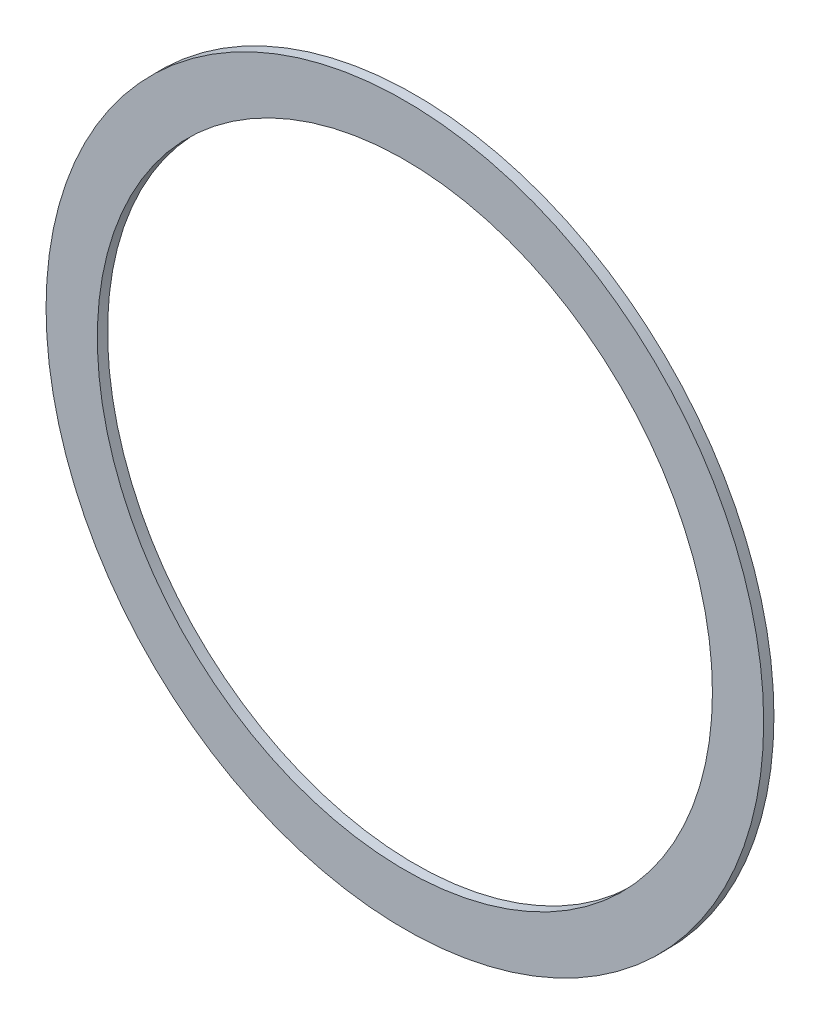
ISO-10303-21;
HEADER;
FILE_DESCRIPTION(('STEP AP214'),'2;1');
FILE_NAME('part.step','',(''),(''),'','','');
FILE_SCHEMA(('AUTOMOTIVE_DESIGN { 1 0 10303 214 1 1 1 1 }'));
ENDSEC;
DATA;
#1=APPLICATION_CONTEXT('core data for automotive mechanical design processes');
#2=APPLICATION_PROTOCOL_DEFINITION('international standard','automotive_design',2000,#1);
#3=PRODUCT_CONTEXT('',#1,'mechanical');
#4=PRODUCT('Part','Part','',(#3));
#5=PRODUCT_RELATED_PRODUCT_CATEGORY('part','',(#4));
#6=PRODUCT_DEFINITION_FORMATION('','',#4);
#7=PRODUCT_DEFINITION_CONTEXT('part definition',#1,'design');
#8=PRODUCT_DEFINITION('design','',#6,#7);
#9=PRODUCT_DEFINITION_SHAPE('','',#8);
#10=(LENGTH_UNIT() NAMED_UNIT(*) SI_UNIT(.MILLI.,.METRE.));
#11=(NAMED_UNIT(*) PLANE_ANGLE_UNIT() SI_UNIT($,.RADIAN.));
#12=(NAMED_UNIT(*) SI_UNIT($,.STERADIAN.) SOLID_ANGLE_UNIT());
#13=UNCERTAINTY_MEASURE_WITH_UNIT(LENGTH_MEASURE(1.E-05),#10,'distance_accuracy_value','');
#14=(GEOMETRIC_REPRESENTATION_CONTEXT(3) GLOBAL_UNCERTAINTY_ASSIGNED_CONTEXT((#13)) GLOBAL_UNIT_ASSIGNED_CONTEXT((#10,
#11,#12)) REPRESENTATION_CONTEXT('',''));
#15=CARTESIAN_POINT('',(0.,0.,0.));
#16=DIRECTION('',(0.,0.,1.));
#17=DIRECTION('',(1.,0.,0.));
#18=AXIS2_PLACEMENT_3D('',#15,#16,#17);
#19=CARTESIAN_POINT('',(0.,0.,0.5));
#20=DIRECTION('',(0.,0.,1.));
#21=DIRECTION('',(1.,0.,0.));
#22=AXIS2_PLACEMENT_3D('',#19,#20,#21);
#23=PLANE('',#22);
#24=CARTESIAN_POINT('',(0.,0.,0.5));
#25=DIRECTION('',(0.,0.,1.));
#26=DIRECTION('',(1.,0.,0.));
#27=AXIS2_PLACEMENT_3D('',#24,#25,#26);
#28=CIRCLE('',#27,17.5);
#29=CARTESIAN_POINT('',(17.5,0.,0.5));
#30=VERTEX_POINT('',#29);
#31=EDGE_CURVE('E12',#30,#30,#28,.T.);
#32=ORIENTED_EDGE('',*,*,#31,.T.);
#33=EDGE_LOOP('',(#32));
#34=FACE_BOUND('',#33,.T.);
#35=CARTESIAN_POINT('',(0.,0.,0.5));
#36=DIRECTION('',(0.,0.,1.));
#37=DIRECTION('',(1.,0.,0.));
#38=AXIS2_PLACEMENT_3D('',#35,#36,#37);
#39=CIRCLE('',#38,15.);
#40=CARTESIAN_POINT('',(15.,0.,0.5));
#41=VERTEX_POINT('',#40);
#42=EDGE_CURVE('E55',#41,#41,#39,.T.);
#43=ORIENTED_EDGE('',*,*,#42,.F.);
#44=EDGE_LOOP('',(#43));
#45=FACE_BOUND('',#44,.T.);
#46=ADVANCED_FACE('F44',(#34,#45),#23,.T.);
#47=CARTESIAN_POINT('',(0.,0.,0.));
#48=DIRECTION('',(0.,0.,1.));
#49=DIRECTION('',(1.,0.,0.));
#50=AXIS2_PLACEMENT_3D('',#47,#48,#49);
#51=PLANE('',#50);
#52=CARTESIAN_POINT('',(0.,0.,0.));
#53=DIRECTION('',(0.,0.,1.));
#54=DIRECTION('',(1.,0.,0.));
#55=AXIS2_PLACEMENT_3D('',#52,#53,#54);
#56=CIRCLE('',#55,17.5);
#57=CARTESIAN_POINT('',(17.5,0.,0.));
#58=VERTEX_POINT('',#57);
#59=EDGE_CURVE('E48',#58,#58,#56,.T.);
#60=ORIENTED_EDGE('',*,*,#59,.F.);
#61=EDGE_LOOP('',(#60));
#62=FACE_BOUND('',#61,.T.);
#63=CARTESIAN_POINT('',(0.,0.,0.));
#64=DIRECTION('',(0.,0.,1.));
#65=DIRECTION('',(1.,0.,0.));
#66=AXIS2_PLACEMENT_3D('',#63,#64,#65);
#67=CIRCLE('',#66,15.);
#68=CARTESIAN_POINT('',(15.,0.,0.));
#69=VERTEX_POINT('',#68);
#70=EDGE_CURVE('E57',#69,#69,#67,.T.);
#71=ORIENTED_EDGE('',*,*,#70,.T.);
#72=EDGE_LOOP('',(#71));
#73=FACE_BOUND('',#72,.T.);
#74=ADVANCED_FACE('F67',(#62,#73),#51,.F.);
#75=CARTESIAN_POINT('',(0.,0.,0.5));
#76=DIRECTION('',(0.,0.,-1.));
#77=DIRECTION('',(-1.,0.,0.));
#78=AXIS2_PLACEMENT_3D('',#75,#76,#77);
#79=CYLINDRICAL_SURFACE('',#78,17.5);
#80=ORIENTED_EDGE('',*,*,#31,.F.);
#81=EDGE_LOOP('',(#80));
#82=FACE_BOUND('',#81,.T.);
#83=ORIENTED_EDGE('',*,*,#59,.T.);
#84=EDGE_LOOP('',(#83));
#85=FACE_BOUND('',#84,.T.);
#86=ADVANCED_FACE('F46',(#82,#85),#79,.T.);
#87=CARTESIAN_POINT('',(0.,0.,0.5));
#88=DIRECTION('',(0.,0.,-1.));
#89=DIRECTION('',(-1.,0.,0.));
#90=AXIS2_PLACEMENT_3D('',#87,#88,#89);
#91=CYLINDRICAL_SURFACE('',#90,15.);
#92=ORIENTED_EDGE('',*,*,#42,.T.);
#93=EDGE_LOOP('',(#92));
#94=FACE_BOUND('',#93,.T.);
#95=ORIENTED_EDGE('',*,*,#70,.F.);
#96=EDGE_LOOP('',(#95));
#97=FACE_BOUND('',#96,.T.);
#98=ADVANCED_FACE('F63',(#94,#97),#91,.F.);
#99=CLOSED_SHELL('',(#46,#74,#86,#98));
#100=MANIFOLD_SOLID_BREP('B2',#99);
#101=ADVANCED_BREP_SHAPE_REPRESENTATION('',(#18,#100),#14);
#102=SHAPE_DEFINITION_REPRESENTATION(#9,#101);
ENDSEC;
END-ISO-10303-21;
